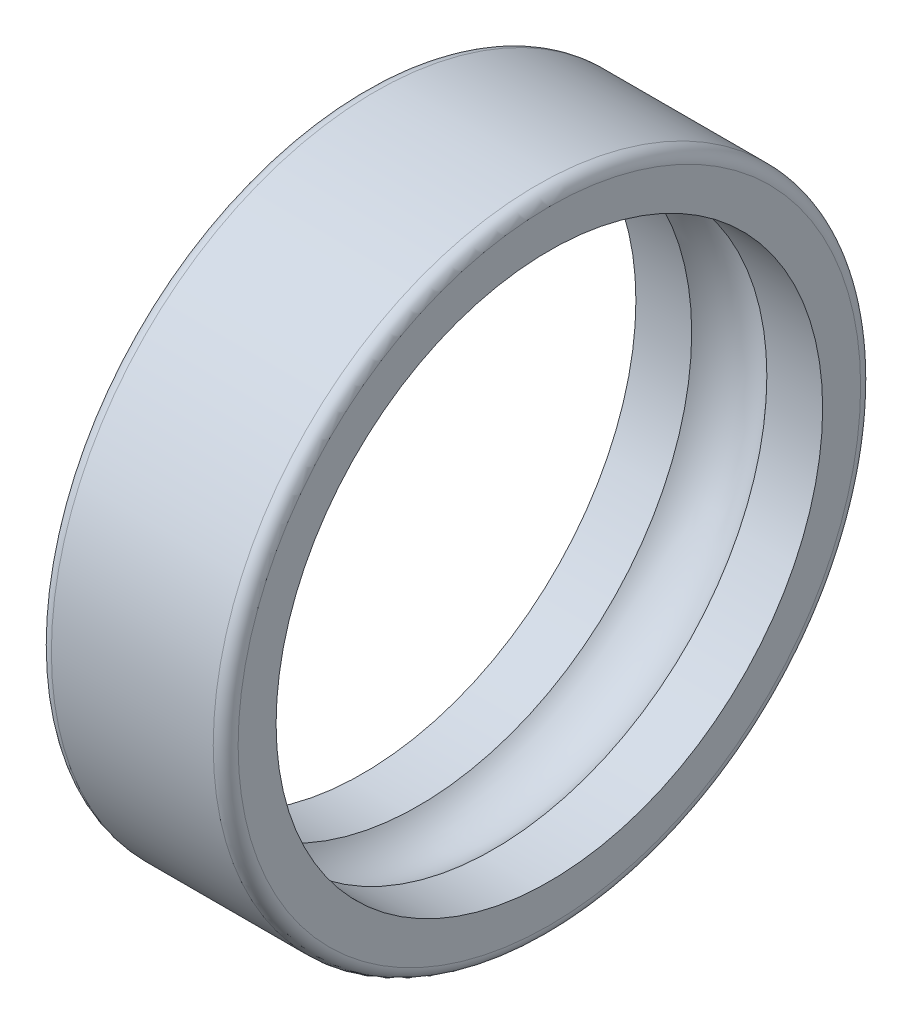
from build123d import *


with BuildPart() as part:
    # Esquisse1 → Base-R_volution (revolve)
    with BuildSketch(Plane(origin=(0, 0, 0), x_dir=(1, 0, 0), z_dir=(0, 1, 0)), mode=Mode.PRIVATE) as base_r_volution_sk:
        with BuildLine():
            Line((0, 25), (0, 21.95))
            Line((0, 21.95), (4.48130823, 21.95))
            ThreePointArc((4.48130823, 21.95), (7.5, 23.3), (10.51869177, 21.95))
            Line((10.51869177, 21.95), (15, 21.95))
            Line((15, 21.95), (15, 25))
            ThreePointArc((15, 25), (14.707106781, 25.707106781), (14, 26))
            Line((14, 26), (1, 26))
            ThreePointArc((1, 26), (0.292893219, 25.707106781), (0, 25))
        make_face()
    revolve(base_r_volution_sk.sketch.rotate(Axis((0, 0, 0), (1, 0, 0)), 180), axis=Axis((0, 0, 0), (1, 0, 0)))


solid = part.part
